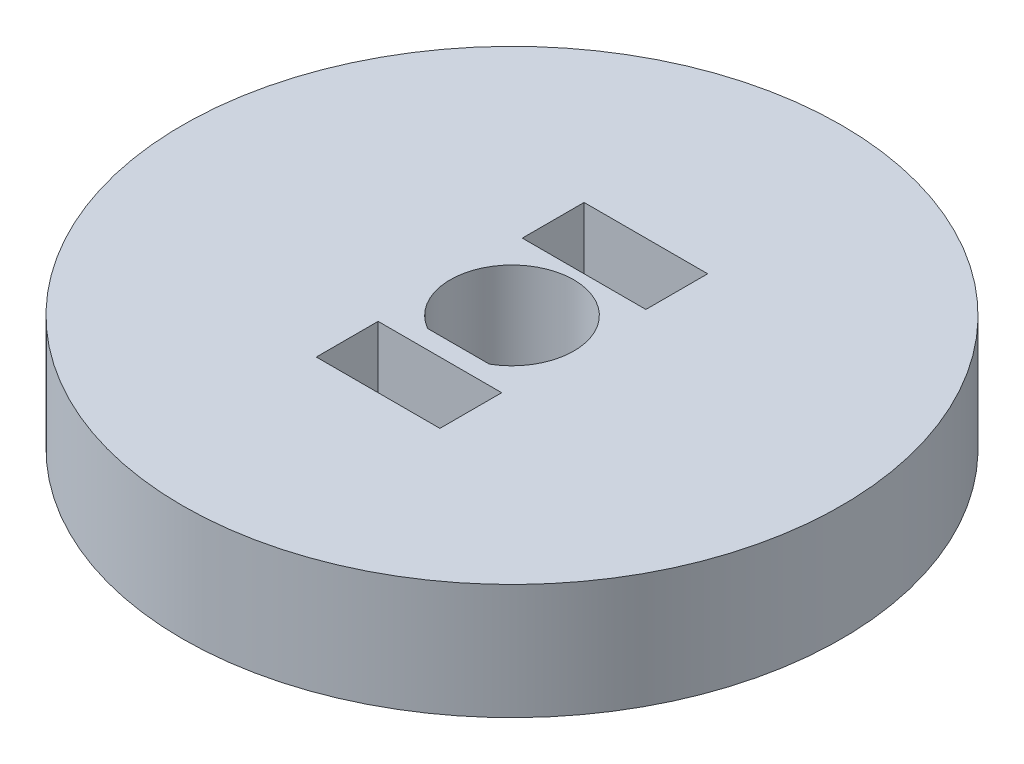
ISO-10303-21;
HEADER;
FILE_DESCRIPTION(('STEP AP214'),'2;1');
FILE_NAME('part.step','',(''),(''),'','','');
FILE_SCHEMA(('AUTOMOTIVE_DESIGN { 1 0 10303 214 1 1 1 1 }'));
ENDSEC;
DATA;
#1=APPLICATION_CONTEXT('core data for automotive mechanical design processes');
#2=APPLICATION_PROTOCOL_DEFINITION('international standard','automotive_design',2000,#1);
#3=PRODUCT_CONTEXT('',#1,'mechanical');
#4=PRODUCT('Part','Part','',(#3));
#5=PRODUCT_RELATED_PRODUCT_CATEGORY('part','',(#4));
#6=PRODUCT_DEFINITION_FORMATION('','',#4);
#7=PRODUCT_DEFINITION_CONTEXT('part definition',#1,'design');
#8=PRODUCT_DEFINITION('design','',#6,#7);
#9=PRODUCT_DEFINITION_SHAPE('','',#8);
#10=(LENGTH_UNIT() NAMED_UNIT(*) SI_UNIT(.MILLI.,.METRE.));
#11=(NAMED_UNIT(*) PLANE_ANGLE_UNIT() SI_UNIT($,.RADIAN.));
#12=(NAMED_UNIT(*) SI_UNIT($,.STERADIAN.) SOLID_ANGLE_UNIT());
#13=UNCERTAINTY_MEASURE_WITH_UNIT(LENGTH_MEASURE(1.E-05),#10,'distance_accuracy_value','');
#14=(GEOMETRIC_REPRESENTATION_CONTEXT(3) GLOBAL_UNCERTAINTY_ASSIGNED_CONTEXT((#13)) GLOBAL_UNIT_ASSIGNED_CONTEXT((#10,
#11,#12)) REPRESENTATION_CONTEXT('',''));
#15=CARTESIAN_POINT('',(0.,0.,0.));
#16=DIRECTION('',(0.,0.,1.));
#17=DIRECTION('',(1.,0.,0.));
#18=AXIS2_PLACEMENT_3D('',#15,#16,#17);
#19=CARTESIAN_POINT('',(0.,5.6,0.));
#20=DIRECTION('',(0.,1.,0.));
#21=DIRECTION('',(0.,0.,1.));
#22=AXIS2_PLACEMENT_3D('',#19,#20,#21);
#23=PLANE('',#22);
#24=DIRECTION('',(0.,0.,1.));
#25=VECTOR('',#24,1.);
#26=CARTESIAN_POINT('',(-3.,5.6,3.5));
#27=LINE('',#26,#25);
#28=CARTESIAN_POINT('',(-3.,5.6,3.5));
#29=VERTEX_POINT('',#28);
#30=CARTESIAN_POINT('',(-3.,5.6,6.5));
#31=VERTEX_POINT('',#30);
#32=EDGE_CURVE('E47',#29,#31,#27,.T.);
#33=ORIENTED_EDGE('',*,*,#32,.F.);
#34=DIRECTION('',(-1.,0.,0.));
#35=VECTOR('',#34,1.);
#36=CARTESIAN_POINT('',(-3.,5.6,3.5));
#37=LINE('',#36,#35);
#38=CARTESIAN_POINT('',(3.,5.6,3.5));
#39=VERTEX_POINT('',#38);
#40=EDGE_CURVE('E132',#39,#29,#37,.T.);
#41=ORIENTED_EDGE('',*,*,#40,.F.);
#42=DIRECTION('',(0.,0.,-1.));
#43=VECTOR('',#42,1.);
#44=CARTESIAN_POINT('',(3.,5.6,6.5));
#45=LINE('',#44,#43);
#46=CARTESIAN_POINT('',(3.,5.6,6.5));
#47=VERTEX_POINT('',#46);
#48=EDGE_CURVE('E116',#47,#39,#45,.T.);
#49=ORIENTED_EDGE('',*,*,#48,.F.);
#50=DIRECTION('',(1.,0.,0.));
#51=VECTOR('',#50,1.);
#52=CARTESIAN_POINT('',(-3.,5.6,6.5));
#53=LINE('',#52,#51);
#54=EDGE_CURVE('E126',#31,#47,#53,.T.);
#55=ORIENTED_EDGE('',*,*,#54,.F.);
#56=EDGE_LOOP('',(#33,#41,#49,#55));
#57=FACE_BOUND('',#56,.T.);
#58=DIRECTION('',(0.,0.,1.));
#59=VECTOR('',#58,1.);
#60=CARTESIAN_POINT('',(-3.,5.6,-6.5));
#61=LINE('',#60,#59);
#62=CARTESIAN_POINT('',(-3.,5.6,-6.5));
#63=VERTEX_POINT('',#62);
#64=CARTESIAN_POINT('',(-3.,5.6,-3.5));
#65=VERTEX_POINT('',#64);
#66=EDGE_CURVE('E55',#63,#65,#61,.T.);
#67=ORIENTED_EDGE('',*,*,#66,.F.);
#68=DIRECTION('',(-1.,0.,0.));
#69=VECTOR('',#68,1.);
#70=CARTESIAN_POINT('',(3.,5.6,-6.5));
#71=LINE('',#70,#69);
#72=CARTESIAN_POINT('',(3.,5.6,-6.5));
#73=VERTEX_POINT('',#72);
#74=EDGE_CURVE('E149',#73,#63,#71,.T.);
#75=ORIENTED_EDGE('',*,*,#74,.F.);
#76=DIRECTION('',(0.,0.,-1.));
#77=VECTOR('',#76,1.);
#78=CARTESIAN_POINT('',(3.,5.6,-3.5));
#79=LINE('',#78,#77);
#80=CARTESIAN_POINT('',(3.,5.6,-3.5));
#81=VERTEX_POINT('',#80);
#82=EDGE_CURVE('E146',#81,#73,#79,.T.);
#83=ORIENTED_EDGE('',*,*,#82,.F.);
#84=DIRECTION('',(1.,0.,0.));
#85=VECTOR('',#84,1.);
#86=CARTESIAN_POINT('',(-3.,5.6,-3.5));
#87=LINE('',#86,#85);
#88=EDGE_CURVE('E143',#65,#81,#87,.T.);
#89=ORIENTED_EDGE('',*,*,#88,.F.);
#90=EDGE_LOOP('',(#67,#75,#83,#89));
#91=FACE_BOUND('',#90,.T.);
#92=CARTESIAN_POINT('',(0.,5.6,0.));
#93=DIRECTION('',(0.,1.,0.));
#94=DIRECTION('',(0.,0.,1.));
#95=AXIS2_PLACEMENT_3D('',#92,#93,#94);
#96=CIRCLE('',#95,16.);
#97=CARTESIAN_POINT('',(0.,5.6,16.));
#98=VERTEX_POINT('',#97);
#99=EDGE_CURVE('E177',#98,#98,#96,.T.);
#100=ORIENTED_EDGE('',*,*,#99,.T.);
#101=EDGE_LOOP('',(#100));
#102=FACE_BOUND('',#101,.T.);
#103=DIRECTION('',(1.,0.,0.));
#104=VECTOR('',#103,1.);
#105=CARTESIAN_POINT('',(-1.5,5.6,2.59807621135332));
#106=LINE('',#105,#104);
#107=CARTESIAN_POINT('',(-1.5,5.6,2.59807621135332));
#108=VERTEX_POINT('',#107);
#109=CARTESIAN_POINT('',(1.5,5.6,2.59807621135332));
#110=VERTEX_POINT('',#109);
#111=EDGE_CURVE('E163',#108,#110,#106,.T.);
#112=ORIENTED_EDGE('',*,*,#111,.F.);
#113=CARTESIAN_POINT('',(0.,5.6,0.));
#114=DIRECTION('',(0.,1.,0.));
#115=DIRECTION('',(0.,0.,1.));
#116=AXIS2_PLACEMENT_3D('',#113,#114,#115);
#117=CIRCLE('',#116,3.);
#118=EDGE_CURVE('E160',#110,#108,#117,.T.);
#119=ORIENTED_EDGE('',*,*,#118,.F.);
#120=EDGE_LOOP('',(#112,#119));
#121=FACE_BOUND('',#120,.T.);
#122=ADVANCED_FACE('F32',(#57,#91,#102,#121),#23,.T.);
#123=CARTESIAN_POINT('',(0.,0.,0.));
#124=DIRECTION('',(0.,1.,0.));
#125=DIRECTION('',(0.,0.,1.));
#126=AXIS2_PLACEMENT_3D('',#123,#124,#125);
#127=PLANE('',#126);
#128=DIRECTION('',(-1.,0.,0.));
#129=VECTOR('',#128,1.);
#130=CARTESIAN_POINT('',(0.,0.,3.5));
#131=LINE('',#130,#129);
#132=CARTESIAN_POINT('',(3.,0.,3.5));
#133=VERTEX_POINT('',#132);
#134=CARTESIAN_POINT('',(-3.,0.,3.5));
#135=VERTEX_POINT('',#134);
#136=EDGE_CURVE('E40',#133,#135,#131,.T.);
#137=ORIENTED_EDGE('',*,*,#136,.T.);
#138=DIRECTION('',(0.,0.,1.));
#139=VECTOR('',#138,1.);
#140=CARTESIAN_POINT('',(-3.,0.,0.));
#141=LINE('',#140,#139);
#142=CARTESIAN_POINT('',(-3.,0.,6.5));
#143=VERTEX_POINT('',#142);
#144=EDGE_CURVE('E11',#135,#143,#141,.T.);
#145=ORIENTED_EDGE('',*,*,#144,.T.);
#146=DIRECTION('',(1.,0.,0.));
#147=VECTOR('',#146,1.);
#148=CARTESIAN_POINT('',(0.,0.,6.5));
#149=LINE('',#148,#147);
#150=CARTESIAN_POINT('',(3.,0.,6.5));
#151=VERTEX_POINT('',#150);
#152=EDGE_CURVE('E194',#143,#151,#149,.T.);
#153=ORIENTED_EDGE('',*,*,#152,.T.);
#154=DIRECTION('',(0.,0.,-1.));
#155=VECTOR('',#154,1.);
#156=CARTESIAN_POINT('',(3.,0.,0.));
#157=LINE('',#156,#155);
#158=EDGE_CURVE('E119',#151,#133,#157,.T.);
#159=ORIENTED_EDGE('',*,*,#158,.T.);
#160=EDGE_LOOP('',(#137,#145,#153,#159));
#161=FACE_BOUND('',#160,.T.);
#162=DIRECTION('',(-1.,0.,0.));
#163=VECTOR('',#162,1.);
#164=CARTESIAN_POINT('',(0.,0.,-6.5));
#165=LINE('',#164,#163);
#166=CARTESIAN_POINT('',(3.,0.,-6.5));
#167=VERTEX_POINT('',#166);
#168=CARTESIAN_POINT('',(-3.,0.,-6.5));
#169=VERTEX_POINT('',#168);
#170=EDGE_CURVE('E188',#167,#169,#165,.T.);
#171=ORIENTED_EDGE('',*,*,#170,.T.);
#172=DIRECTION('',(0.,0.,1.));
#173=VECTOR('',#172,1.);
#174=CARTESIAN_POINT('',(-3.,0.,0.));
#175=LINE('',#174,#173);
#176=CARTESIAN_POINT('',(-3.,0.,-3.5));
#177=VERTEX_POINT('',#176);
#178=EDGE_CURVE('E191',#169,#177,#175,.T.);
#179=ORIENTED_EDGE('',*,*,#178,.T.);
#180=DIRECTION('',(1.,0.,0.));
#181=VECTOR('',#180,1.);
#182=CARTESIAN_POINT('',(0.,0.,-3.5));
#183=LINE('',#182,#181);
#184=CARTESIAN_POINT('',(3.,0.,-3.5));
#185=VERTEX_POINT('',#184);
#186=EDGE_CURVE('E180',#177,#185,#183,.T.);
#187=ORIENTED_EDGE('',*,*,#186,.T.);
#188=DIRECTION('',(0.,0.,-1.));
#189=VECTOR('',#188,1.);
#190=CARTESIAN_POINT('',(3.,0.,0.));
#191=LINE('',#190,#189);
#192=EDGE_CURVE('E185',#185,#167,#191,.T.);
#193=ORIENTED_EDGE('',*,*,#192,.T.);
#194=EDGE_LOOP('',(#171,#179,#187,#193));
#195=FACE_BOUND('',#194,.T.);
#196=CARTESIAN_POINT('',(0.,0.,0.));
#197=DIRECTION('',(0.,1.,0.));
#198=DIRECTION('',(0.,0.,1.));
#199=AXIS2_PLACEMENT_3D('',#196,#197,#198);
#200=CIRCLE('',#199,16.);
#201=CARTESIAN_POINT('',(0.,0.,16.));
#202=VERTEX_POINT('',#201);
#203=EDGE_CURVE('E176',#202,#202,#200,.T.);
#204=ORIENTED_EDGE('',*,*,#203,.F.);
#205=EDGE_LOOP('',(#204));
#206=FACE_BOUND('',#205,.T.);
#207=CARTESIAN_POINT('',(0.,0.,0.));
#208=DIRECTION('',(0.,1.,0.));
#209=DIRECTION('',(0.,0.,1.));
#210=AXIS2_PLACEMENT_3D('',#207,#208,#209);
#211=CIRCLE('',#210,3.);
#212=CARTESIAN_POINT('',(1.5,0.,2.59807621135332));
#213=VERTEX_POINT('',#212);
#214=CARTESIAN_POINT('',(-1.5,0.,2.59807621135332));
#215=VERTEX_POINT('',#214);
#216=EDGE_CURVE('E139',#213,#215,#211,.T.);
#217=ORIENTED_EDGE('',*,*,#216,.T.);
#218=DIRECTION('',(1.,0.,0.));
#219=VECTOR('',#218,1.);
#220=CARTESIAN_POINT('',(-1.5,0.,2.59807621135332));
#221=LINE('',#220,#219);
#222=EDGE_CURVE('E164',#215,#213,#221,.T.);
#223=ORIENTED_EDGE('',*,*,#222,.T.);
#224=EDGE_LOOP('',(#217,#223));
#225=FACE_BOUND('',#224,.T.);
#226=ADVANCED_FACE('F198',(#161,#195,#206,#225),#127,.F.);
#227=CARTESIAN_POINT('',(0.,5.6,0.));
#228=DIRECTION('',(0.,-1.,0.));
#229=DIRECTION('',(0.,0.,-1.));
#230=AXIS2_PLACEMENT_3D('',#227,#228,#229);
#231=CYLINDRICAL_SURFACE('',#230,16.);
#232=ORIENTED_EDGE('',*,*,#99,.F.);
#233=EDGE_LOOP('',(#232));
#234=FACE_BOUND('',#233,.T.);
#235=ORIENTED_EDGE('',*,*,#203,.T.);
#236=EDGE_LOOP('',(#235));
#237=FACE_BOUND('',#236,.T.);
#238=ADVANCED_FACE('F34',(#234,#237),#231,.T.);
#239=CARTESIAN_POINT('',(0.,5.6,0.));
#240=DIRECTION('',(0.,-1.,0.));
#241=DIRECTION('',(0.,0.,-1.));
#242=AXIS2_PLACEMENT_3D('',#239,#240,#241);
#243=CYLINDRICAL_SURFACE('',#242,3.);
#244=ORIENTED_EDGE('',*,*,#216,.F.);
#245=DIRECTION('',(0.,-1.,0.));
#246=VECTOR('',#245,1.);
#247=CARTESIAN_POINT('',(1.5,5.6,2.59807621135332));
#248=LINE('',#247,#246);
#249=EDGE_CURVE('E166',#110,#213,#248,.T.);
#250=ORIENTED_EDGE('',*,*,#249,.F.);
#251=ORIENTED_EDGE('',*,*,#118,.T.);
#252=DIRECTION('',(0.,-1.,0.));
#253=VECTOR('',#252,1.);
#254=CARTESIAN_POINT('',(-1.5,5.6,2.59807621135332));
#255=LINE('',#254,#253);
#256=EDGE_CURVE('E173',#108,#215,#255,.T.);
#257=ORIENTED_EDGE('',*,*,#256,.T.);
#258=EDGE_LOOP('',(#244,#250,#251,#257));
#259=FACE_BOUND('',#258,.T.);
#260=ADVANCED_FACE('F223',(#259),#243,.F.);
#261=CARTESIAN_POINT('',(-1.5,5.6,2.59807621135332));
#262=DIRECTION('',(0.,0.,-1.));
#263=DIRECTION('',(-1.,0.,0.));
#264=AXIS2_PLACEMENT_3D('',#261,#262,#263);
#265=PLANE('',#264);
#266=ORIENTED_EDGE('',*,*,#222,.F.);
#267=ORIENTED_EDGE('',*,*,#256,.F.);
#268=ORIENTED_EDGE('',*,*,#111,.T.);
#269=ORIENTED_EDGE('',*,*,#249,.T.);
#270=EDGE_LOOP('',(#266,#267,#268,#269));
#271=FACE_BOUND('',#270,.T.);
#272=ADVANCED_FACE('F226',(#271),#265,.T.);
#273=CARTESIAN_POINT('',(-3.,-0.4,-6.5));
#274=DIRECTION('',(-1.,0.,0.));
#275=DIRECTION('',(0.,0.,1.));
#276=AXIS2_PLACEMENT_3D('',#273,#274,#275);
#277=PLANE('',#276);
#278=DIRECTION('',(0.,1.,0.));
#279=VECTOR('',#278,1.);
#280=CARTESIAN_POINT('',(-3.,-0.4,-6.5));
#281=LINE('',#280,#279);
#282=EDGE_CURVE('E153',#169,#63,#281,.T.);
#283=ORIENTED_EDGE('',*,*,#282,.T.);
#284=ORIENTED_EDGE('',*,*,#66,.T.);
#285=DIRECTION('',(0.,1.,0.));
#286=VECTOR('',#285,1.);
#287=CARTESIAN_POINT('',(-3.,-0.4,-3.5));
#288=LINE('',#287,#286);
#289=EDGE_CURVE('E152',#177,#65,#288,.T.);
#290=ORIENTED_EDGE('',*,*,#289,.F.);
#291=ORIENTED_EDGE('',*,*,#178,.F.);
#292=EDGE_LOOP('',(#283,#284,#290,#291));
#293=FACE_BOUND('',#292,.T.);
#294=ADVANCED_FACE('F230',(#293),#277,.F.);
#295=CARTESIAN_POINT('',(3.,-0.4,-6.5));
#296=DIRECTION('',(0.,0.,-1.));
#297=DIRECTION('',(-1.,0.,0.));
#298=AXIS2_PLACEMENT_3D('',#295,#296,#297);
#299=PLANE('',#298);
#300=DIRECTION('',(0.,1.,0.));
#301=VECTOR('',#300,1.);
#302=CARTESIAN_POINT('',(3.,-0.4,-6.5));
#303=LINE('',#302,#301);
#304=EDGE_CURVE('E155',#167,#73,#303,.T.);
#305=ORIENTED_EDGE('',*,*,#304,.T.);
#306=ORIENTED_EDGE('',*,*,#74,.T.);
#307=ORIENTED_EDGE('',*,*,#282,.F.);
#308=ORIENTED_EDGE('',*,*,#170,.F.);
#309=EDGE_LOOP('',(#305,#306,#307,#308));
#310=FACE_BOUND('',#309,.T.);
#311=ADVANCED_FACE('F233',(#310),#299,.F.);
#312=CARTESIAN_POINT('',(3.,-0.4,-3.5));
#313=DIRECTION('',(1.,0.,0.));
#314=DIRECTION('',(0.,0.,-1.));
#315=AXIS2_PLACEMENT_3D('',#312,#313,#314);
#316=PLANE('',#315);
#317=DIRECTION('',(0.,1.,0.));
#318=VECTOR('',#317,1.);
#319=CARTESIAN_POINT('',(3.,-0.4,-3.5));
#320=LINE('',#319,#318);
#321=EDGE_CURVE('E157',#185,#81,#320,.T.);
#322=ORIENTED_EDGE('',*,*,#321,.T.);
#323=ORIENTED_EDGE('',*,*,#82,.T.);
#324=ORIENTED_EDGE('',*,*,#304,.F.);
#325=ORIENTED_EDGE('',*,*,#192,.F.);
#326=EDGE_LOOP('',(#322,#323,#324,#325));
#327=FACE_BOUND('',#326,.T.);
#328=ADVANCED_FACE('F212',(#327),#316,.F.);
#329=CARTESIAN_POINT('',(-3.,-0.4,-3.5));
#330=DIRECTION('',(0.,0.,1.));
#331=DIRECTION('',(1.,0.,0.));
#332=AXIS2_PLACEMENT_3D('',#329,#330,#331);
#333=PLANE('',#332);
#334=ORIENTED_EDGE('',*,*,#289,.T.);
#335=ORIENTED_EDGE('',*,*,#88,.T.);
#336=ORIENTED_EDGE('',*,*,#321,.F.);
#337=ORIENTED_EDGE('',*,*,#186,.F.);
#338=EDGE_LOOP('',(#334,#335,#336,#337));
#339=FACE_BOUND('',#338,.T.);
#340=ADVANCED_FACE('F205',(#339),#333,.F.);
#341=CARTESIAN_POINT('',(-3.,-0.4,3.5));
#342=DIRECTION('',(-1.,0.,0.));
#343=DIRECTION('',(0.,0.,1.));
#344=AXIS2_PLACEMENT_3D('',#341,#342,#343);
#345=PLANE('',#344);
#346=DIRECTION('',(0.,1.,0.));
#347=VECTOR('',#346,1.);
#348=CARTESIAN_POINT('',(-3.,-0.4,3.5));
#349=LINE('',#348,#347);
#350=EDGE_CURVE('E137',#135,#29,#349,.T.);
#351=ORIENTED_EDGE('',*,*,#350,.T.);
#352=ORIENTED_EDGE('',*,*,#32,.T.);
#353=DIRECTION('',(0.,1.,0.));
#354=VECTOR('',#353,1.);
#355=CARTESIAN_POINT('',(-3.,-0.4,6.5));
#356=LINE('',#355,#354);
#357=EDGE_CURVE('E123',#143,#31,#356,.T.);
#358=ORIENTED_EDGE('',*,*,#357,.F.);
#359=ORIENTED_EDGE('',*,*,#144,.F.);
#360=EDGE_LOOP('',(#351,#352,#358,#359));
#361=FACE_BOUND('',#360,.T.);
#362=ADVANCED_FACE('F203',(#361),#345,.F.);
#363=CARTESIAN_POINT('',(-3.,-0.4,3.5));
#364=DIRECTION('',(0.,0.,-1.));
#365=DIRECTION('',(-1.,0.,0.));
#366=AXIS2_PLACEMENT_3D('',#363,#364,#365);
#367=PLANE('',#366);
#368=DIRECTION('',(0.,1.,0.));
#369=VECTOR('',#368,1.);
#370=CARTESIAN_POINT('',(3.,-0.4,3.5));
#371=LINE('',#370,#369);
#372=EDGE_CURVE('E122',#133,#39,#371,.T.);
#373=ORIENTED_EDGE('',*,*,#372,.T.);
#374=ORIENTED_EDGE('',*,*,#40,.T.);
#375=ORIENTED_EDGE('',*,*,#350,.F.);
#376=ORIENTED_EDGE('',*,*,#136,.F.);
#377=EDGE_LOOP('',(#373,#374,#375,#376));
#378=FACE_BOUND('',#377,.T.);
#379=ADVANCED_FACE('F202',(#378),#367,.F.);
#380=CARTESIAN_POINT('',(3.,-0.4,6.5));
#381=DIRECTION('',(1.,0.,0.));
#382=DIRECTION('',(0.,0.,-1.));
#383=AXIS2_PLACEMENT_3D('',#380,#381,#382);
#384=PLANE('',#383);
#385=DIRECTION('',(0.,1.,0.));
#386=VECTOR('',#385,1.);
#387=CARTESIAN_POINT('',(3.,-0.4,6.5));
#388=LINE('',#387,#386);
#389=EDGE_CURVE('E111',#151,#47,#388,.T.);
#390=ORIENTED_EDGE('',*,*,#389,.T.);
#391=ORIENTED_EDGE('',*,*,#48,.T.);
#392=ORIENTED_EDGE('',*,*,#372,.F.);
#393=ORIENTED_EDGE('',*,*,#158,.F.);
#394=EDGE_LOOP('',(#390,#391,#392,#393));
#395=FACE_BOUND('',#394,.T.);
#396=ADVANCED_FACE('F113',(#395),#384,.F.);
#397=CARTESIAN_POINT('',(-3.,-0.4,6.5));
#398=DIRECTION('',(0.,0.,1.));
#399=DIRECTION('',(1.,0.,0.));
#400=AXIS2_PLACEMENT_3D('',#397,#398,#399);
#401=PLANE('',#400);
#402=ORIENTED_EDGE('',*,*,#357,.T.);
#403=ORIENTED_EDGE('',*,*,#54,.T.);
#404=ORIENTED_EDGE('',*,*,#389,.F.);
#405=ORIENTED_EDGE('',*,*,#152,.F.);
#406=EDGE_LOOP('',(#402,#403,#404,#405));
#407=FACE_BOUND('',#406,.T.);
#408=ADVANCED_FACE('F127',(#407),#401,.F.);
#409=CLOSED_SHELL('',(#122,#226,#238,#260,#272,#294,#311,#328,#340,#362,#379,#396,#408));
#410=MANIFOLD_SOLID_BREP('B2',#409);
#411=ADVANCED_BREP_SHAPE_REPRESENTATION('',(#18,#410),#14);
#412=SHAPE_DEFINITION_REPRESENTATION(#9,#411);
ENDSEC;
END-ISO-10303-21;
